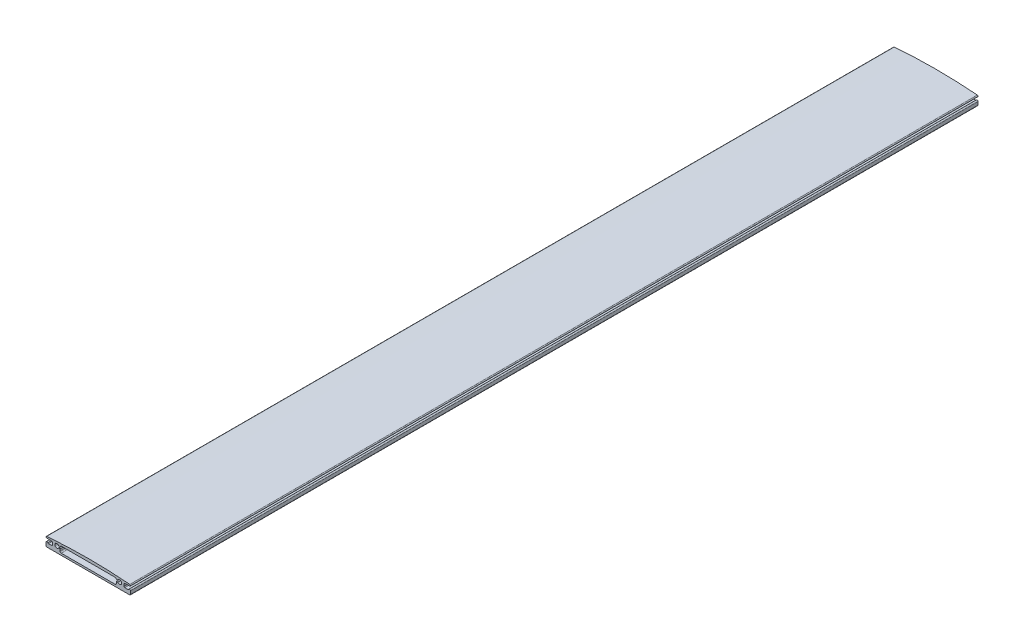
ISO-10303-21;
HEADER;
FILE_DESCRIPTION(('STEP AP214'),'2;1');
FILE_NAME('part.step','',(''),(''),'','','');
FILE_SCHEMA(('AUTOMOTIVE_DESIGN { 1 0 10303 214 1 1 1 1 }'));
ENDSEC;
DATA;
#1=APPLICATION_CONTEXT('core data for automotive mechanical design processes');
#2=APPLICATION_PROTOCOL_DEFINITION('international standard','automotive_design',2000,#1);
#3=PRODUCT_CONTEXT('',#1,'mechanical');
#4=PRODUCT('Part','Part','',(#3));
#5=PRODUCT_RELATED_PRODUCT_CATEGORY('part','',(#4));
#6=PRODUCT_DEFINITION_FORMATION('','',#4);
#7=PRODUCT_DEFINITION_CONTEXT('part definition',#1,'design');
#8=PRODUCT_DEFINITION('design','',#6,#7);
#9=PRODUCT_DEFINITION_SHAPE('','',#8);
#10=(LENGTH_UNIT() NAMED_UNIT(*) SI_UNIT(.MILLI.,.METRE.));
#11=(NAMED_UNIT(*) PLANE_ANGLE_UNIT() SI_UNIT($,.RADIAN.));
#12=(NAMED_UNIT(*) SI_UNIT($,.STERADIAN.) SOLID_ANGLE_UNIT());
#13=UNCERTAINTY_MEASURE_WITH_UNIT(LENGTH_MEASURE(1.E-05),#10,'distance_accuracy_value','');
#14=(GEOMETRIC_REPRESENTATION_CONTEXT(3) GLOBAL_UNCERTAINTY_ASSIGNED_CONTEXT((#13)) GLOBAL_UNIT_ASSIGNED_CONTEXT((#10,
#11,#12)) REPRESENTATION_CONTEXT('',''));
#15=CARTESIAN_POINT('',(0.,0.,0.));
#16=DIRECTION('',(0.,0.,1.));
#17=DIRECTION('',(1.,0.,0.));
#18=AXIS2_PLACEMENT_3D('',#15,#16,#17);
#19=CARTESIAN_POINT('',(32.4,-4.4,331.15));
#20=DIRECTION('',(0.,0.,-1.));
#21=DIRECTION('',(-1.,0.,0.));
#22=AXIS2_PLACEMENT_3D('',#19,#20,#21);
#23=PLANE('',#22);
#24=DIRECTION('',(1.,0.,0.));
#25=VECTOR('',#24,1.);
#26=CARTESIAN_POINT('',(-22.,-5.,331.15));
#27=LINE('',#26,#25);
#28=CARTESIAN_POINT('',(-32.4,-5.,331.15));
#29=VERTEX_POINT('',#28);
#30=CARTESIAN_POINT('',(32.4,-5.00000000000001,331.15));
#31=VERTEX_POINT('',#30);
#32=EDGE_CURVE('E317',#29,#31,#27,.T.);
#33=ORIENTED_EDGE('',*,*,#32,.T.);
#34=CARTESIAN_POINT('',(32.4,-4.4,331.15));
#35=DIRECTION('',(0.,0.,1.));
#36=DIRECTION('',(-1.,0.,0.));
#37=AXIS2_PLACEMENT_3D('',#34,#35,#36);
#38=CIRCLE('',#37,0.600000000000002);
#39=CARTESIAN_POINT('',(33.,-4.4,331.15));
#40=VERTEX_POINT('',#39);
#41=EDGE_CURVE('E319',#31,#40,#38,.T.);
#42=ORIENTED_EDGE('',*,*,#41,.T.);
#43=DIRECTION('',(0.,1.,0.));
#44=VECTOR('',#43,1.);
#45=CARTESIAN_POINT('',(33.,-4.4,331.15));
#46=LINE('',#45,#44);
#47=CARTESIAN_POINT('',(33.,-2.,331.15));
#48=VERTEX_POINT('',#47);
#49=EDGE_CURVE('E322',#40,#48,#46,.T.);
#50=ORIENTED_EDGE('',*,*,#49,.T.);
#51=CARTESIAN_POINT('',(32.25,-2.,331.15));
#52=DIRECTION('',(0.,0.,1.));
#53=DIRECTION('',(-1.,0.,0.));
#54=AXIS2_PLACEMENT_3D('',#51,#52,#53);
#55=CIRCLE('',#54,0.75);
#56=CARTESIAN_POINT('',(31.5626136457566,-1.7,331.15));
#57=VERTEX_POINT('',#56);
#58=EDGE_CURVE('E324',#48,#57,#55,.T.);
#59=ORIENTED_EDGE('',*,*,#58,.T.);
#60=CARTESIAN_POINT('',(31.104356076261,-1.5,331.15));
#61=DIRECTION('',(0.,0.,-1.));
#62=DIRECTION('',(-1.,0.,0.));
#63=AXIS2_PLACEMENT_3D('',#60,#61,#62);
#64=CIRCLE('',#63,0.500000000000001);
#65=CARTESIAN_POINT('',(31.104356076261,-2.,331.15));
#66=VERTEX_POINT('',#65);
#67=EDGE_CURVE('E326',#57,#66,#64,.T.);
#68=ORIENTED_EDGE('',*,*,#67,.T.);
#69=DIRECTION('',(-1.,0.,0.));
#70=VECTOR('',#69,1.);
#71=CARTESIAN_POINT('',(31.104356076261,-2.,331.15));
#72=LINE('',#71,#70);
#73=CARTESIAN_POINT('',(28.6,-2.,331.15));
#74=VERTEX_POINT('',#73);
#75=EDGE_CURVE('E328',#66,#74,#72,.T.);
#76=ORIENTED_EDGE('',*,*,#75,.T.);
#77=CARTESIAN_POINT('',(28.6,-1.4,331.15));
#78=DIRECTION('',(0.,0.,-1.));
#79=DIRECTION('',(1.,0.,0.));
#80=AXIS2_PLACEMENT_3D('',#77,#78,#79);
#81=CIRCLE('',#80,0.6);
#82=CARTESIAN_POINT('',(28.,-1.4,331.15));
#83=VERTEX_POINT('',#82);
#84=EDGE_CURVE('E330',#74,#83,#81,.T.);
#85=ORIENTED_EDGE('',*,*,#84,.T.);
#86=DIRECTION('',(0.,1.,0.));
#87=VECTOR('',#86,1.);
#88=CARTESIAN_POINT('',(28.,0.149999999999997,331.15));
#89=LINE('',#88,#87);
#90=CARTESIAN_POINT('',(28.,0.149999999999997,331.15));
#91=VERTEX_POINT('',#90);
#92=EDGE_CURVE('E332',#83,#91,#89,.T.);
#93=ORIENTED_EDGE('',*,*,#92,.T.);
#94=CARTESIAN_POINT('',(28.85,0.149999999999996,331.15));
#95=DIRECTION('',(0.,0.,-1.));
#96=DIRECTION('',(-1.,0.,0.));
#97=AXIS2_PLACEMENT_3D('',#94,#95,#96);
#98=CIRCLE('',#97,0.850000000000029);
#99=CARTESIAN_POINT('',(28.85,0.999999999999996,331.15));
#100=VERTEX_POINT('',#99);
#101=EDGE_CURVE('E334',#91,#100,#98,.T.);
#102=ORIENTED_EDGE('',*,*,#101,.T.);
#103=DIRECTION('',(1.,0.,0.));
#104=VECTOR('',#103,1.);
#105=CARTESIAN_POINT('',(32.3999999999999,0.999999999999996,331.15));
#106=LINE('',#105,#104);
#107=CARTESIAN_POINT('',(32.3999999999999,0.999999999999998,331.15));
#108=VERTEX_POINT('',#107);
#109=EDGE_CURVE('E336',#100,#108,#106,.T.);
#110=ORIENTED_EDGE('',*,*,#109,.T.);
#111=CARTESIAN_POINT('',(32.4,1.60048941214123,331.15));
#112=DIRECTION('',(0.,0.,1.));
#113=DIRECTION('',(1.,0.,0.));
#114=AXIS2_PLACEMENT_3D('',#111,#112,#113);
#115=CIRCLE('',#114,0.600489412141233);
#116=CARTESIAN_POINT('',(32.4484386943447,2.19902197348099,331.15));
#117=VERTEX_POINT('',#116);
#118=EDGE_CURVE('E338',#108,#117,#115,.T.);
#119=ORIENTED_EDGE('',*,*,#118,.T.);
#120=CARTESIAN_POINT('',(0.,-398.75,331.15));
#121=DIRECTION('',(0.,0.,1.));
#122=DIRECTION('',(-1.,0.,0.));
#123=AXIS2_PLACEMENT_3D('',#120,#121,#122);
#124=CIRCLE('',#123,402.259890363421);
#125=CARTESIAN_POINT('',(-32.4484386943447,2.19902197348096,331.15));
#126=VERTEX_POINT('',#125);
#127=EDGE_CURVE('E340',#117,#126,#124,.T.);
#128=ORIENTED_EDGE('',*,*,#127,.T.);
#129=CARTESIAN_POINT('',(-32.4,1.60048941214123,331.15));
#130=DIRECTION('',(0.,0.,1.));
#131=DIRECTION('',(-1.,0.,0.));
#132=AXIS2_PLACEMENT_3D('',#129,#130,#131);
#133=CIRCLE('',#132,0.600489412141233);
#134=CARTESIAN_POINT('',(-32.3999999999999,0.999999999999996,331.15));
#135=VERTEX_POINT('',#134);
#136=EDGE_CURVE('E342',#126,#135,#133,.T.);
#137=ORIENTED_EDGE('',*,*,#136,.T.);
#138=DIRECTION('',(1.,0.,0.));
#139=VECTOR('',#138,1.);
#140=CARTESIAN_POINT('',(-32.3999999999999,0.999999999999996,331.15));
#141=LINE('',#140,#139);
#142=CARTESIAN_POINT('',(-28.85,1.00000000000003,331.15));
#143=VERTEX_POINT('',#142);
#144=EDGE_CURVE('E344',#135,#143,#141,.T.);
#145=ORIENTED_EDGE('',*,*,#144,.T.);
#146=CARTESIAN_POINT('',(-28.85,0.149999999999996,331.15));
#147=DIRECTION('',(0.,0.,-1.));
#148=DIRECTION('',(1.,0.,0.));
#149=AXIS2_PLACEMENT_3D('',#146,#147,#148);
#150=CIRCLE('',#149,0.850000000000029);
#151=CARTESIAN_POINT('',(-28.,0.149999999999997,331.15));
#152=VERTEX_POINT('',#151);
#153=EDGE_CURVE('E346',#143,#152,#150,.T.);
#154=ORIENTED_EDGE('',*,*,#153,.T.);
#155=DIRECTION('',(0.,-1.,0.));
#156=VECTOR('',#155,1.);
#157=CARTESIAN_POINT('',(-28.,0.149999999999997,331.15));
#158=LINE('',#157,#156);
#159=CARTESIAN_POINT('',(-28.,-1.4,331.15));
#160=VERTEX_POINT('',#159);
#161=EDGE_CURVE('E348',#152,#160,#158,.T.);
#162=ORIENTED_EDGE('',*,*,#161,.T.);
#163=CARTESIAN_POINT('',(-28.6,-1.4,331.15));
#164=DIRECTION('',(0.,0.,-1.));
#165=DIRECTION('',(-1.,0.,0.));
#166=AXIS2_PLACEMENT_3D('',#163,#164,#165);
#167=CIRCLE('',#166,0.6);
#168=CARTESIAN_POINT('',(-28.6,-2.,331.15));
#169=VERTEX_POINT('',#168);
#170=EDGE_CURVE('E350',#160,#169,#167,.T.);
#171=ORIENTED_EDGE('',*,*,#170,.T.);
#172=DIRECTION('',(-1.,0.,0.));
#173=VECTOR('',#172,1.);
#174=CARTESIAN_POINT('',(-31.104356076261,-2.,331.15));
#175=LINE('',#174,#173);
#176=CARTESIAN_POINT('',(-31.104356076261,-2.,331.15));
#177=VERTEX_POINT('',#176);
#178=EDGE_CURVE('E352',#169,#177,#175,.T.);
#179=ORIENTED_EDGE('',*,*,#178,.T.);
#180=CARTESIAN_POINT('',(-31.104356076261,-1.5,331.15));
#181=DIRECTION('',(0.,0.,-1.));
#182=DIRECTION('',(1.,0.,0.));
#183=AXIS2_PLACEMENT_3D('',#180,#181,#182);
#184=CIRCLE('',#183,0.500000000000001);
#185=CARTESIAN_POINT('',(-31.5626136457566,-1.7,331.15));
#186=VERTEX_POINT('',#185);
#187=EDGE_CURVE('E354',#177,#186,#184,.T.);
#188=ORIENTED_EDGE('',*,*,#187,.T.);
#189=CARTESIAN_POINT('',(-32.25,-2.,331.15));
#190=DIRECTION('',(0.,0.,1.));
#191=DIRECTION('',(1.,0.,0.));
#192=AXIS2_PLACEMENT_3D('',#189,#190,#191);
#193=CIRCLE('',#192,0.75);
#194=CARTESIAN_POINT('',(-33.,-2.,331.15));
#195=VERTEX_POINT('',#194);
#196=EDGE_CURVE('E356',#186,#195,#193,.T.);
#197=ORIENTED_EDGE('',*,*,#196,.T.);
#198=DIRECTION('',(0.,-1.,0.));
#199=VECTOR('',#198,1.);
#200=CARTESIAN_POINT('',(-33.,-4.4,331.15));
#201=LINE('',#200,#199);
#202=CARTESIAN_POINT('',(-33.,-4.4,331.15));
#203=VERTEX_POINT('',#202);
#204=EDGE_CURVE('E358',#195,#203,#201,.T.);
#205=ORIENTED_EDGE('',*,*,#204,.T.);
#206=CARTESIAN_POINT('',(-32.4,-4.4,331.15));
#207=DIRECTION('',(0.,0.,1.));
#208=DIRECTION('',(1.,0.,0.));
#209=AXIS2_PLACEMENT_3D('',#206,#207,#208);
#210=CIRCLE('',#209,0.600000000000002);
#211=EDGE_CURVE('E360',#203,#29,#210,.T.);
#212=ORIENTED_EDGE('',*,*,#211,.T.);
#213=EDGE_LOOP('',(#33,#42,#50,#59,#68,#76,#85,#93,#102,#110,#119,#128,#137,#145,#154,#162,#171,
#179,#188,#197,#205,#212));
#214=FACE_BOUND('',#213,.T.);
#215=DIRECTION('',(0.,-1.,0.));
#216=VECTOR('',#215,1.);
#217=CARTESIAN_POINT('',(-22.,-2.50000000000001,331.15));
#218=LINE('',#217,#216);
#219=CARTESIAN_POINT('',(-22.,-1.,331.15));
#220=VERTEX_POINT('',#219);
#221=CARTESIAN_POINT('',(-22.,-2.50000000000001,331.15));
#222=VERTEX_POINT('',#221);
#223=EDGE_CURVE('E916',#220,#222,#218,.T.);
#224=ORIENTED_EDGE('',*,*,#223,.F.);
#225=DIRECTION('',(1.,0.,0.));
#226=VECTOR('',#225,1.);
#227=CARTESIAN_POINT('',(-23.0853950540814,-1.,331.15));
#228=LINE('',#227,#226);
#229=CARTESIAN_POINT('',(-23.0853950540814,-1.,331.15));
#230=VERTEX_POINT('',#229);
#231=EDGE_CURVE('E31',#230,#220,#228,.T.);
#232=ORIENTED_EDGE('',*,*,#231,.F.);
#233=CARTESIAN_POINT('',(-24.4987244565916,-0.250000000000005,331.15));
#234=DIRECTION('',(0.,0.,1.));
#235=DIRECTION('',(1.,0.,0.));
#236=AXIS2_PLACEMENT_3D('',#233,#234,#235);
#237=CIRCLE('',#236,1.6);
#238=CARTESIAN_POINT('',(-23.0853950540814,0.499999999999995,331.15));
#239=VERTEX_POINT('',#238);
#240=EDGE_CURVE('E909',#239,#230,#237,.T.);
#241=ORIENTED_EDGE('',*,*,#240,.F.);
#242=DIRECTION('',(-1.,0.,0.));
#243=VECTOR('',#242,1.);
#244=CARTESIAN_POINT('',(-23.0853950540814,0.499999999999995,331.15));
#245=LINE('',#244,#243);
#246=CARTESIAN_POINT('',(-21.9682458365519,0.499999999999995,331.15));
#247=VERTEX_POINT('',#246);
#248=EDGE_CURVE('E912',#247,#239,#245,.T.);
#249=ORIENTED_EDGE('',*,*,#248,.F.);
#250=CARTESIAN_POINT('',(-21.,0.249999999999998,331.15));
#251=DIRECTION('',(0.,0.,1.));
#252=DIRECTION('',(-1.,0.,0.));
#253=AXIS2_PLACEMENT_3D('',#250,#251,#252);
#254=CIRCLE('',#253,1.);
#255=CARTESIAN_POINT('',(-21.,1.25,331.15));
#256=VERTEX_POINT('',#255);
#257=EDGE_CURVE('E268',#256,#247,#254,.T.);
#258=ORIENTED_EDGE('',*,*,#257,.F.);
#259=DIRECTION('',(-1.,0.,0.));
#260=VECTOR('',#259,1.);
#261=CARTESIAN_POINT('',(-21.,1.25,331.15));
#262=LINE('',#261,#260);
#263=CARTESIAN_POINT('',(21.,1.25,331.15));
#264=VERTEX_POINT('',#263);
#265=EDGE_CURVE('E285',#264,#256,#262,.T.);
#266=ORIENTED_EDGE('',*,*,#265,.F.);
#267=CARTESIAN_POINT('',(21.,0.249999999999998,331.15));
#268=DIRECTION('',(0.,0.,1.));
#269=DIRECTION('',(1.,0.,0.));
#270=AXIS2_PLACEMENT_3D('',#267,#268,#269);
#271=CIRCLE('',#270,1.);
#272=CARTESIAN_POINT('',(21.9682458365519,0.499999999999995,331.15));
#273=VERTEX_POINT('',#272);
#274=EDGE_CURVE('E955',#273,#264,#271,.T.);
#275=ORIENTED_EDGE('',*,*,#274,.F.);
#276=DIRECTION('',(-1.,0.,0.));
#277=VECTOR('',#276,1.);
#278=CARTESIAN_POINT('',(23.0853950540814,0.499999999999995,331.15));
#279=LINE('',#278,#277);
#280=CARTESIAN_POINT('',(23.0853950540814,0.499999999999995,331.15));
#281=VERTEX_POINT('',#280);
#282=EDGE_CURVE('E39',#281,#273,#279,.T.);
#283=ORIENTED_EDGE('',*,*,#282,.F.);
#284=CARTESIAN_POINT('',(24.4987244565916,-0.250000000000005,331.15));
#285=DIRECTION('',(0.,0.,1.));
#286=DIRECTION('',(-1.,0.,0.));
#287=AXIS2_PLACEMENT_3D('',#284,#285,#286);
#288=CIRCLE('',#287,1.6);
#289=CARTESIAN_POINT('',(23.0853950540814,-1.00000000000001,331.15));
#290=VERTEX_POINT('',#289);
#291=EDGE_CURVE('E937',#290,#281,#288,.T.);
#292=ORIENTED_EDGE('',*,*,#291,.F.);
#293=DIRECTION('',(1.,0.,0.));
#294=VECTOR('',#293,1.);
#295=CARTESIAN_POINT('',(23.0853950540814,-1.,331.15));
#296=LINE('',#295,#294);
#297=CARTESIAN_POINT('',(22.,-1.,331.15));
#298=VERTEX_POINT('',#297);
#299=EDGE_CURVE('E922',#298,#290,#296,.T.);
#300=ORIENTED_EDGE('',*,*,#299,.F.);
#301=DIRECTION('',(0.,1.,0.));
#302=VECTOR('',#301,1.);
#303=CARTESIAN_POINT('',(22.,-2.5,331.15));
#304=LINE('',#303,#302);
#305=CARTESIAN_POINT('',(22.,-2.5,331.15));
#306=VERTEX_POINT('',#305);
#307=EDGE_CURVE('E953',#306,#298,#304,.T.);
#308=ORIENTED_EDGE('',*,*,#307,.F.);
#309=CARTESIAN_POINT('',(21.,-2.5,331.15));
#310=DIRECTION('',(0.,0.,1.));
#311=DIRECTION('',(-1.,0.,0.));
#312=AXIS2_PLACEMENT_3D('',#309,#310,#311);
#313=CIRCLE('',#312,1.);
#314=CARTESIAN_POINT('',(21.,-3.5,331.15));
#315=VERTEX_POINT('',#314);
#316=EDGE_CURVE('E951',#315,#306,#313,.T.);
#317=ORIENTED_EDGE('',*,*,#316,.F.);
#318=DIRECTION('',(1.,0.,0.));
#319=VECTOR('',#318,1.);
#320=CARTESIAN_POINT('',(21.,-3.5,331.15));
#321=LINE('',#320,#319);
#322=CARTESIAN_POINT('',(-21.,-3.50000000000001,331.15));
#323=VERTEX_POINT('',#322);
#324=EDGE_CURVE('E949',#323,#315,#321,.T.);
#325=ORIENTED_EDGE('',*,*,#324,.F.);
#326=CARTESIAN_POINT('',(-21.,-2.50000000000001,331.15));
#327=DIRECTION('',(0.,0.,1.));
#328=DIRECTION('',(-1.,0.,0.));
#329=AXIS2_PLACEMENT_3D('',#326,#327,#328);
#330=CIRCLE('',#329,1.);
#331=EDGE_CURVE('E947',#222,#323,#330,.T.);
#332=ORIENTED_EDGE('',*,*,#331,.F.);
#333=EDGE_LOOP('',(#224,#232,#241,#249,#258,#266,#275,#283,#292,#300,#308,#317,#325,#332));
#334=FACE_BOUND('',#333,.T.);
#335=ADVANCED_FACE('F16',(#214,#334),#23,.F.);
#336=CARTESIAN_POINT('',(32.4,-4.4,-331.15));
#337=DIRECTION('',(0.,0.,-1.));
#338=DIRECTION('',(-1.,0.,0.));
#339=AXIS2_PLACEMENT_3D('',#336,#337,#338);
#340=PLANE('',#339);
#341=DIRECTION('',(1.,0.,0.));
#342=VECTOR('',#341,1.);
#343=CARTESIAN_POINT('',(-23.0853950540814,-1.,-331.15));
#344=LINE('',#343,#342);
#345=CARTESIAN_POINT('',(-23.0853950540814,-1.,-331.15));
#346=VERTEX_POINT('',#345);
#347=CARTESIAN_POINT('',(-22.,-1.,-331.15));
#348=VERTEX_POINT('',#347);
#349=EDGE_CURVE('E269',#346,#348,#344,.T.);
#350=ORIENTED_EDGE('',*,*,#349,.T.);
#351=DIRECTION('',(0.,-1.,0.));
#352=VECTOR('',#351,1.);
#353=CARTESIAN_POINT('',(-22.,-2.50000000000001,-331.15));
#354=LINE('',#353,#352);
#355=CARTESIAN_POINT('',(-22.,-2.50000000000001,-331.15));
#356=VERTEX_POINT('',#355);
#357=EDGE_CURVE('E277',#348,#356,#354,.T.);
#358=ORIENTED_EDGE('',*,*,#357,.T.);
#359=CARTESIAN_POINT('',(-21.,-2.50000000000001,-331.15));
#360=DIRECTION('',(0.,0.,1.));
#361=DIRECTION('',(-1.,0.,0.));
#362=AXIS2_PLACEMENT_3D('',#359,#360,#361);
#363=CIRCLE('',#362,1.);
#364=CARTESIAN_POINT('',(-21.,-3.50000000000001,-331.15));
#365=VERTEX_POINT('',#364);
#366=EDGE_CURVE('E280',#356,#365,#363,.T.);
#367=ORIENTED_EDGE('',*,*,#366,.T.);
#368=DIRECTION('',(1.,0.,0.));
#369=VECTOR('',#368,1.);
#370=CARTESIAN_POINT('',(21.,-3.5,-331.15));
#371=LINE('',#370,#369);
#372=CARTESIAN_POINT('',(21.,-3.5,-331.15));
#373=VERTEX_POINT('',#372);
#374=EDGE_CURVE('E290',#365,#373,#371,.T.);
#375=ORIENTED_EDGE('',*,*,#374,.T.);
#376=CARTESIAN_POINT('',(21.,-2.5,-331.15));
#377=DIRECTION('',(0.,0.,1.));
#378=DIRECTION('',(-1.,0.,0.));
#379=AXIS2_PLACEMENT_3D('',#376,#377,#378);
#380=CIRCLE('',#379,1.);
#381=CARTESIAN_POINT('',(22.,-2.5,-331.15));
#382=VERTEX_POINT('',#381);
#383=EDGE_CURVE('E293',#373,#382,#380,.T.);
#384=ORIENTED_EDGE('',*,*,#383,.T.);
#385=DIRECTION('',(0.,1.,0.));
#386=VECTOR('',#385,1.);
#387=CARTESIAN_POINT('',(22.,-2.5,-331.15));
#388=LINE('',#387,#386);
#389=CARTESIAN_POINT('',(22.,-1.,-331.15));
#390=VERTEX_POINT('',#389);
#391=EDGE_CURVE('E296',#382,#390,#388,.T.);
#392=ORIENTED_EDGE('',*,*,#391,.T.);
#393=DIRECTION('',(1.,0.,0.));
#394=VECTOR('',#393,1.);
#395=CARTESIAN_POINT('',(23.0853950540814,-1.,-331.15));
#396=LINE('',#395,#394);
#397=CARTESIAN_POINT('',(23.0853950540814,-1.00000000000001,-331.15));
#398=VERTEX_POINT('',#397);
#399=EDGE_CURVE('E925',#390,#398,#396,.T.);
#400=ORIENTED_EDGE('',*,*,#399,.T.);
#401=CARTESIAN_POINT('',(24.4987244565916,-0.250000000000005,-331.15));
#402=DIRECTION('',(0.,0.,1.));
#403=DIRECTION('',(-1.,0.,0.));
#404=AXIS2_PLACEMENT_3D('',#401,#402,#403);
#405=CIRCLE('',#404,1.6);
#406=CARTESIAN_POINT('',(23.0853950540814,0.499999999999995,-331.15));
#407=VERTEX_POINT('',#406);
#408=EDGE_CURVE('E928',#398,#407,#405,.T.);
#409=ORIENTED_EDGE('',*,*,#408,.T.);
#410=DIRECTION('',(-1.,0.,0.));
#411=VECTOR('',#410,1.);
#412=CARTESIAN_POINT('',(23.0853950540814,0.499999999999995,-331.15));
#413=LINE('',#412,#411);
#414=CARTESIAN_POINT('',(21.9682458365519,0.499999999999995,-331.15));
#415=VERTEX_POINT('',#414);
#416=EDGE_CURVE('E931',#407,#415,#413,.T.);
#417=ORIENTED_EDGE('',*,*,#416,.T.);
#418=CARTESIAN_POINT('',(21.,0.249999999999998,-331.15));
#419=DIRECTION('',(0.,0.,1.));
#420=DIRECTION('',(1.,0.,0.));
#421=AXIS2_PLACEMENT_3D('',#418,#419,#420);
#422=CIRCLE('',#421,1.);
#423=CARTESIAN_POINT('',(21.,1.25,-331.15));
#424=VERTEX_POINT('',#423);
#425=EDGE_CURVE('E299',#415,#424,#422,.T.);
#426=ORIENTED_EDGE('',*,*,#425,.T.);
#427=DIRECTION('',(-1.,0.,0.));
#428=VECTOR('',#427,1.);
#429=CARTESIAN_POINT('',(-21.,1.25,-331.15));
#430=LINE('',#429,#428);
#431=CARTESIAN_POINT('',(-21.,1.25,-331.15));
#432=VERTEX_POINT('',#431);
#433=EDGE_CURVE('E276',#424,#432,#430,.T.);
#434=ORIENTED_EDGE('',*,*,#433,.T.);
#435=CARTESIAN_POINT('',(-21.,0.249999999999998,-331.15));
#436=DIRECTION('',(0.,0.,1.));
#437=DIRECTION('',(-1.,0.,0.));
#438=AXIS2_PLACEMENT_3D('',#435,#436,#437);
#439=CIRCLE('',#438,1.);
#440=CARTESIAN_POINT('',(-21.9682458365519,0.499999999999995,-331.15));
#441=VERTEX_POINT('',#440);
#442=EDGE_CURVE('E265',#432,#441,#439,.T.);
#443=ORIENTED_EDGE('',*,*,#442,.T.);
#444=DIRECTION('',(-1.,0.,0.));
#445=VECTOR('',#444,1.);
#446=CARTESIAN_POINT('',(-23.0853950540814,0.499999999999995,-331.15));
#447=LINE('',#446,#445);
#448=CARTESIAN_POINT('',(-23.0853950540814,0.499999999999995,-331.15));
#449=VERTEX_POINT('',#448);
#450=EDGE_CURVE('E248',#441,#449,#447,.T.);
#451=ORIENTED_EDGE('',*,*,#450,.T.);
#452=CARTESIAN_POINT('',(-24.4987244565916,-0.250000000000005,-331.15));
#453=DIRECTION('',(0.,0.,1.));
#454=DIRECTION('',(1.,0.,0.));
#455=AXIS2_PLACEMENT_3D('',#452,#453,#454);
#456=CIRCLE('',#455,1.6);
#457=EDGE_CURVE('E259',#449,#346,#456,.T.);
#458=ORIENTED_EDGE('',*,*,#457,.T.);
#459=EDGE_LOOP('',(#350,#358,#367,#375,#384,#392,#400,#409,#417,#426,#434,#443,#451,#458));
#460=FACE_BOUND('',#459,.T.);
#461=CARTESIAN_POINT('',(32.4,-4.4,-331.15));
#462=DIRECTION('',(0.,0.,1.));
#463=DIRECTION('',(-1.,0.,0.));
#464=AXIS2_PLACEMENT_3D('',#461,#462,#463);
#465=CIRCLE('',#464,0.600000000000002);
#466=CARTESIAN_POINT('',(32.4,-5.00000000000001,-331.15));
#467=VERTEX_POINT('',#466);
#468=CARTESIAN_POINT('',(33.,-4.4,-331.15));
#469=VERTEX_POINT('',#468);
#470=EDGE_CURVE('E316',#467,#469,#465,.T.);
#471=ORIENTED_EDGE('',*,*,#470,.F.);
#472=DIRECTION('',(1.,0.,0.));
#473=VECTOR('',#472,1.);
#474=CARTESIAN_POINT('',(-22.,-5.,-331.15));
#475=LINE('',#474,#473);
#476=CARTESIAN_POINT('',(-32.4,-5.,-331.15));
#477=VERTEX_POINT('',#476);
#478=EDGE_CURVE('E320',#477,#467,#475,.T.);
#479=ORIENTED_EDGE('',*,*,#478,.F.);
#480=CARTESIAN_POINT('',(-32.4,-4.4,-331.15));
#481=DIRECTION('',(0.,0.,1.));
#482=DIRECTION('',(1.,0.,0.));
#483=AXIS2_PLACEMENT_3D('',#480,#481,#482);
#484=CIRCLE('',#483,0.600000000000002);
#485=CARTESIAN_POINT('',(-33.,-4.4,-331.15));
#486=VERTEX_POINT('',#485);
#487=EDGE_CURVE('E403',#486,#477,#484,.T.);
#488=ORIENTED_EDGE('',*,*,#487,.F.);
#489=DIRECTION('',(0.,-1.,0.));
#490=VECTOR('',#489,1.);
#491=CARTESIAN_POINT('',(-33.,-4.4,-331.15));
#492=LINE('',#491,#490);
#493=CARTESIAN_POINT('',(-33.,-2.,-331.15));
#494=VERTEX_POINT('',#493);
#495=EDGE_CURVE('E401',#494,#486,#492,.T.);
#496=ORIENTED_EDGE('',*,*,#495,.F.);
#497=CARTESIAN_POINT('',(-32.25,-2.,-331.15));
#498=DIRECTION('',(0.,0.,1.));
#499=DIRECTION('',(1.,0.,0.));
#500=AXIS2_PLACEMENT_3D('',#497,#498,#499);
#501=CIRCLE('',#500,0.75);
#502=CARTESIAN_POINT('',(-31.5626136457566,-1.7,-331.15));
#503=VERTEX_POINT('',#502);
#504=EDGE_CURVE('E399',#503,#494,#501,.T.);
#505=ORIENTED_EDGE('',*,*,#504,.F.);
#506=CARTESIAN_POINT('',(-31.104356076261,-1.5,-331.15));
#507=DIRECTION('',(0.,0.,-1.));
#508=DIRECTION('',(1.,0.,0.));
#509=AXIS2_PLACEMENT_3D('',#506,#507,#508);
#510=CIRCLE('',#509,0.500000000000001);
#511=CARTESIAN_POINT('',(-31.104356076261,-2.,-331.15));
#512=VERTEX_POINT('',#511);
#513=EDGE_CURVE('E397',#512,#503,#510,.T.);
#514=ORIENTED_EDGE('',*,*,#513,.F.);
#515=DIRECTION('',(-1.,0.,0.));
#516=VECTOR('',#515,1.);
#517=CARTESIAN_POINT('',(-31.104356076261,-2.,-331.15));
#518=LINE('',#517,#516);
#519=CARTESIAN_POINT('',(-28.6,-2.,-331.15));
#520=VERTEX_POINT('',#519);
#521=EDGE_CURVE('E395',#520,#512,#518,.T.);
#522=ORIENTED_EDGE('',*,*,#521,.F.);
#523=CARTESIAN_POINT('',(-28.6,-1.4,-331.15));
#524=DIRECTION('',(0.,0.,-1.));
#525=DIRECTION('',(-1.,0.,0.));
#526=AXIS2_PLACEMENT_3D('',#523,#524,#525);
#527=CIRCLE('',#526,0.6);
#528=CARTESIAN_POINT('',(-28.,-1.4,-331.15));
#529=VERTEX_POINT('',#528);
#530=EDGE_CURVE('E393',#529,#520,#527,.T.);
#531=ORIENTED_EDGE('',*,*,#530,.F.);
#532=DIRECTION('',(0.,-1.,0.));
#533=VECTOR('',#532,1.);
#534=CARTESIAN_POINT('',(-28.,0.149999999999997,-331.15));
#535=LINE('',#534,#533);
#536=CARTESIAN_POINT('',(-28.,0.149999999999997,-331.15));
#537=VERTEX_POINT('',#536);
#538=EDGE_CURVE('E391',#537,#529,#535,.T.);
#539=ORIENTED_EDGE('',*,*,#538,.F.);
#540=CARTESIAN_POINT('',(-28.85,0.149999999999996,-331.15));
#541=DIRECTION('',(0.,0.,-1.));
#542=DIRECTION('',(1.,0.,0.));
#543=AXIS2_PLACEMENT_3D('',#540,#541,#542);
#544=CIRCLE('',#543,0.850000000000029);
#545=CARTESIAN_POINT('',(-28.85,1.00000000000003,-331.15));
#546=VERTEX_POINT('',#545);
#547=EDGE_CURVE('E389',#546,#537,#544,.T.);
#548=ORIENTED_EDGE('',*,*,#547,.F.);
#549=DIRECTION('',(1.,0.,0.));
#550=VECTOR('',#549,1.);
#551=CARTESIAN_POINT('',(-32.3999999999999,0.999999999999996,-331.15));
#552=LINE('',#551,#550);
#553=CARTESIAN_POINT('',(-32.3999999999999,0.999999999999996,-331.15));
#554=VERTEX_POINT('',#553);
#555=EDGE_CURVE('E387',#554,#546,#552,.T.);
#556=ORIENTED_EDGE('',*,*,#555,.F.);
#557=CARTESIAN_POINT('',(-32.4,1.60048941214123,-331.15));
#558=DIRECTION('',(0.,0.,1.));
#559=DIRECTION('',(-1.,0.,0.));
#560=AXIS2_PLACEMENT_3D('',#557,#558,#559);
#561=CIRCLE('',#560,0.600489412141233);
#562=CARTESIAN_POINT('',(-32.4484386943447,2.19902197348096,-331.15));
#563=VERTEX_POINT('',#562);
#564=EDGE_CURVE('E385',#563,#554,#561,.T.);
#565=ORIENTED_EDGE('',*,*,#564,.F.);
#566=CARTESIAN_POINT('',(0.,-398.75,-331.15));
#567=DIRECTION('',(0.,0.,1.));
#568=DIRECTION('',(-1.,0.,0.));
#569=AXIS2_PLACEMENT_3D('',#566,#567,#568);
#570=CIRCLE('',#569,402.259890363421);
#571=CARTESIAN_POINT('',(32.4484386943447,2.19902197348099,-331.15));
#572=VERTEX_POINT('',#571);
#573=EDGE_CURVE('E383',#572,#563,#570,.T.);
#574=ORIENTED_EDGE('',*,*,#573,.F.);
#575=CARTESIAN_POINT('',(32.4,1.60048941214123,-331.15));
#576=DIRECTION('',(0.,0.,1.));
#577=DIRECTION('',(1.,0.,0.));
#578=AXIS2_PLACEMENT_3D('',#575,#576,#577);
#579=CIRCLE('',#578,0.600489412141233);
#580=CARTESIAN_POINT('',(32.3999999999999,0.999999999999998,-331.15));
#581=VERTEX_POINT('',#580);
#582=EDGE_CURVE('E381',#581,#572,#579,.T.);
#583=ORIENTED_EDGE('',*,*,#582,.F.);
#584=DIRECTION('',(1.,0.,0.));
#585=VECTOR('',#584,1.);
#586=CARTESIAN_POINT('',(32.3999999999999,0.999999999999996,-331.15));
#587=LINE('',#586,#585);
#588=CARTESIAN_POINT('',(28.85,0.999999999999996,-331.15));
#589=VERTEX_POINT('',#588);
#590=EDGE_CURVE('E379',#589,#581,#587,.T.);
#591=ORIENTED_EDGE('',*,*,#590,.F.);
#592=CARTESIAN_POINT('',(28.85,0.149999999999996,-331.15));
#593=DIRECTION('',(0.,0.,-1.));
#594=DIRECTION('',(-1.,0.,0.));
#595=AXIS2_PLACEMENT_3D('',#592,#593,#594);
#596=CIRCLE('',#595,0.850000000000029);
#597=CARTESIAN_POINT('',(28.,0.149999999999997,-331.15));
#598=VERTEX_POINT('',#597);
#599=EDGE_CURVE('E377',#598,#589,#596,.T.);
#600=ORIENTED_EDGE('',*,*,#599,.F.);
#601=DIRECTION('',(0.,1.,0.));
#602=VECTOR('',#601,1.);
#603=CARTESIAN_POINT('',(28.,0.149999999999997,-331.15));
#604=LINE('',#603,#602);
#605=CARTESIAN_POINT('',(28.,-1.4,-331.15));
#606=VERTEX_POINT('',#605);
#607=EDGE_CURVE('E375',#606,#598,#604,.T.);
#608=ORIENTED_EDGE('',*,*,#607,.F.);
#609=CARTESIAN_POINT('',(28.6,-1.4,-331.15));
#610=DIRECTION('',(0.,0.,-1.));
#611=DIRECTION('',(1.,0.,0.));
#612=AXIS2_PLACEMENT_3D('',#609,#610,#611);
#613=CIRCLE('',#612,0.6);
#614=CARTESIAN_POINT('',(28.6,-2.,-331.15));
#615=VERTEX_POINT('',#614);
#616=EDGE_CURVE('E373',#615,#606,#613,.T.);
#617=ORIENTED_EDGE('',*,*,#616,.F.);
#618=DIRECTION('',(-1.,0.,0.));
#619=VECTOR('',#618,1.);
#620=CARTESIAN_POINT('',(31.104356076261,-2.,-331.15));
#621=LINE('',#620,#619);
#622=CARTESIAN_POINT('',(31.104356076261,-2.,-331.15));
#623=VERTEX_POINT('',#622);
#624=EDGE_CURVE('E371',#623,#615,#621,.T.);
#625=ORIENTED_EDGE('',*,*,#624,.F.);
#626=CARTESIAN_POINT('',(31.104356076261,-1.5,-331.15));
#627=DIRECTION('',(0.,0.,-1.));
#628=DIRECTION('',(-1.,0.,0.));
#629=AXIS2_PLACEMENT_3D('',#626,#627,#628);
#630=CIRCLE('',#629,0.500000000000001);
#631=CARTESIAN_POINT('',(31.5626136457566,-1.7,-331.15));
#632=VERTEX_POINT('',#631);
#633=EDGE_CURVE('E369',#632,#623,#630,.T.);
#634=ORIENTED_EDGE('',*,*,#633,.F.);
#635=CARTESIAN_POINT('',(32.25,-2.,-331.15));
#636=DIRECTION('',(0.,0.,1.));
#637=DIRECTION('',(-1.,0.,0.));
#638=AXIS2_PLACEMENT_3D('',#635,#636,#637);
#639=CIRCLE('',#638,0.75);
#640=CARTESIAN_POINT('',(33.,-2.,-331.15));
#641=VERTEX_POINT('',#640);
#642=EDGE_CURVE('E367',#641,#632,#639,.T.);
#643=ORIENTED_EDGE('',*,*,#642,.F.);
#644=DIRECTION('',(0.,1.,0.));
#645=VECTOR('',#644,1.);
#646=CARTESIAN_POINT('',(33.,-4.4,-331.15));
#647=LINE('',#646,#645);
#648=EDGE_CURVE('E365',#469,#641,#647,.T.);
#649=ORIENTED_EDGE('',*,*,#648,.F.);
#650=EDGE_LOOP('',(#471,#479,#488,#496,#505,#514,#522,#531,#539,#548,#556,#565,#574,#583,#591,
#600,#608,#617,#625,#634,#643,#649));
#651=FACE_BOUND('',#650,.T.);
#652=ADVANCED_FACE('F273',(#460,#651),#340,.T.);
#653=CARTESIAN_POINT('',(32.4,-4.4,331.15));
#654=DIRECTION('',(0.,0.,-1.));
#655=DIRECTION('',(-1.,0.,0.));
#656=AXIS2_PLACEMENT_3D('',#653,#654,#655);
#657=CYLINDRICAL_SURFACE('',#656,0.600000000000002);
#658=ORIENTED_EDGE('',*,*,#470,.T.);
#659=DIRECTION('',(0.,0.,-1.));
#660=VECTOR('',#659,1.);
#661=CARTESIAN_POINT('',(33.,-4.4,331.15));
#662=LINE('',#661,#660);
#663=EDGE_CURVE('E24',#40,#469,#662,.T.);
#664=ORIENTED_EDGE('',*,*,#663,.F.);
#665=ORIENTED_EDGE('',*,*,#41,.F.);
#666=DIRECTION('',(0.,0.,-1.));
#667=VECTOR('',#666,1.);
#668=CARTESIAN_POINT('',(32.4,-5.00000000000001,331.15));
#669=LINE('',#668,#667);
#670=EDGE_CURVE('E10',#31,#467,#669,.T.);
#671=ORIENTED_EDGE('',*,*,#670,.T.);
#672=EDGE_LOOP('',(#658,#664,#665,#671));
#673=FACE_BOUND('',#672,.T.);
#674=ADVANCED_FACE('F18',(#673),#657,.T.);
#675=CARTESIAN_POINT('',(33.,-4.4,331.15));
#676=DIRECTION('',(-1.,0.,0.));
#677=DIRECTION('',(0.,-1.,0.));
#678=AXIS2_PLACEMENT_3D('',#675,#676,#677);
#679=PLANE('',#678);
#680=ORIENTED_EDGE('',*,*,#648,.T.);
#681=DIRECTION('',(0.,0.,-1.));
#682=VECTOR('',#681,1.);
#683=CARTESIAN_POINT('',(33.,-2.,331.15));
#684=LINE('',#683,#682);
#685=EDGE_CURVE('E462',#48,#641,#684,.T.);
#686=ORIENTED_EDGE('',*,*,#685,.F.);
#687=ORIENTED_EDGE('',*,*,#49,.F.);
#688=ORIENTED_EDGE('',*,*,#663,.T.);
#689=EDGE_LOOP('',(#680,#686,#687,#688));
#690=FACE_BOUND('',#689,.T.);
#691=ADVANCED_FACE('F469',(#690),#679,.F.);
#692=CARTESIAN_POINT('',(32.25,-2.,331.15));
#693=DIRECTION('',(0.,0.,-1.));
#694=DIRECTION('',(-1.,0.,0.));
#695=AXIS2_PLACEMENT_3D('',#692,#693,#694);
#696=CYLINDRICAL_SURFACE('',#695,0.75);
#697=ORIENTED_EDGE('',*,*,#642,.T.);
#698=DIRECTION('',(0.,0.,-1.));
#699=VECTOR('',#698,1.);
#700=CARTESIAN_POINT('',(31.5626136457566,-1.7,331.15));
#701=LINE('',#700,#699);
#702=EDGE_CURVE('E459',#57,#632,#701,.T.);
#703=ORIENTED_EDGE('',*,*,#702,.F.);
#704=ORIENTED_EDGE('',*,*,#58,.F.);
#705=ORIENTED_EDGE('',*,*,#685,.T.);
#706=EDGE_LOOP('',(#697,#703,#704,#705));
#707=FACE_BOUND('',#706,.T.);
#708=ADVANCED_FACE('F480',(#707),#696,.T.);
#709=CARTESIAN_POINT('',(31.104356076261,-1.5,331.15));
#710=DIRECTION('',(0.,0.,-1.));
#711=DIRECTION('',(-1.,0.,0.));
#712=AXIS2_PLACEMENT_3D('',#709,#710,#711);
#713=CYLINDRICAL_SURFACE('',#712,0.500000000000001);
#714=ORIENTED_EDGE('',*,*,#633,.T.);
#715=DIRECTION('',(0.,0.,-1.));
#716=VECTOR('',#715,1.);
#717=CARTESIAN_POINT('',(31.104356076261,-2.,331.15));
#718=LINE('',#717,#716);
#719=EDGE_CURVE('E456',#66,#623,#718,.T.);
#720=ORIENTED_EDGE('',*,*,#719,.F.);
#721=ORIENTED_EDGE('',*,*,#67,.F.);
#722=ORIENTED_EDGE('',*,*,#702,.T.);
#723=EDGE_LOOP('',(#714,#720,#721,#722));
#724=FACE_BOUND('',#723,.T.);
#725=ADVANCED_FACE('F484',(#724),#713,.F.);
#726=CARTESIAN_POINT('',(31.104356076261,-2.,331.15));
#727=DIRECTION('',(0.,-1.,0.));
#728=DIRECTION('',(1.,0.,0.));
#729=AXIS2_PLACEMENT_3D('',#726,#727,#728);
#730=PLANE('',#729);
#731=ORIENTED_EDGE('',*,*,#624,.T.);
#732=DIRECTION('',(0.,0.,-1.));
#733=VECTOR('',#732,1.);
#734=CARTESIAN_POINT('',(28.6,-2.,331.15));
#735=LINE('',#734,#733);
#736=EDGE_CURVE('E453',#74,#615,#735,.T.);
#737=ORIENTED_EDGE('',*,*,#736,.F.);
#738=ORIENTED_EDGE('',*,*,#75,.F.);
#739=ORIENTED_EDGE('',*,*,#719,.T.);
#740=EDGE_LOOP('',(#731,#737,#738,#739));
#741=FACE_BOUND('',#740,.T.);
#742=ADVANCED_FACE('F574',(#741),#730,.F.);
#743=CARTESIAN_POINT('',(28.6,-1.4,331.15));
#744=DIRECTION('',(0.,0.,-1.));
#745=DIRECTION('',(-1.,0.,0.));
#746=AXIS2_PLACEMENT_3D('',#743,#744,#745);
#747=CYLINDRICAL_SURFACE('',#746,0.6);
#748=ORIENTED_EDGE('',*,*,#616,.T.);
#749=DIRECTION('',(0.,0.,-1.));
#750=VECTOR('',#749,1.);
#751=CARTESIAN_POINT('',(28.,-1.4,331.15));
#752=LINE('',#751,#750);
#753=EDGE_CURVE('E450',#83,#606,#752,.T.);
#754=ORIENTED_EDGE('',*,*,#753,.F.);
#755=ORIENTED_EDGE('',*,*,#84,.F.);
#756=ORIENTED_EDGE('',*,*,#736,.T.);
#757=EDGE_LOOP('',(#748,#754,#755,#756));
#758=FACE_BOUND('',#757,.T.);
#759=ADVANCED_FACE('F571',(#758),#747,.F.);
#760=CARTESIAN_POINT('',(28.,0.149999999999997,331.15));
#761=DIRECTION('',(-1.,0.,0.));
#762=DIRECTION('',(0.,-1.,0.));
#763=AXIS2_PLACEMENT_3D('',#760,#761,#762);
#764=PLANE('',#763);
#765=ORIENTED_EDGE('',*,*,#607,.T.);
#766=DIRECTION('',(0.,0.,-1.));
#767=VECTOR('',#766,1.);
#768=CARTESIAN_POINT('',(28.,0.149999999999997,331.15));
#769=LINE('',#768,#767);
#770=EDGE_CURVE('E447',#91,#598,#769,.T.);
#771=ORIENTED_EDGE('',*,*,#770,.F.);
#772=ORIENTED_EDGE('',*,*,#92,.F.);
#773=ORIENTED_EDGE('',*,*,#753,.T.);
#774=EDGE_LOOP('',(#765,#771,#772,#773));
#775=FACE_BOUND('',#774,.T.);
#776=ADVANCED_FACE('F567',(#775),#764,.F.);
#777=CARTESIAN_POINT('',(28.85,0.149999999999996,331.15));
#778=DIRECTION('',(0.,0.,-1.));
#779=DIRECTION('',(-1.,0.,0.));
#780=AXIS2_PLACEMENT_3D('',#777,#778,#779);
#781=CYLINDRICAL_SURFACE('',#780,0.850000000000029);
#782=ORIENTED_EDGE('',*,*,#599,.T.);
#783=DIRECTION('',(0.,0.,-1.));
#784=VECTOR('',#783,1.);
#785=CARTESIAN_POINT('',(28.85,0.999999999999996,331.15));
#786=LINE('',#785,#784);
#787=EDGE_CURVE('E444',#100,#589,#786,.T.);
#788=ORIENTED_EDGE('',*,*,#787,.F.);
#789=ORIENTED_EDGE('',*,*,#101,.F.);
#790=ORIENTED_EDGE('',*,*,#770,.T.);
#791=EDGE_LOOP('',(#782,#788,#789,#790));
#792=FACE_BOUND('',#791,.T.);
#793=ADVANCED_FACE('F563',(#792),#781,.F.);
#794=CARTESIAN_POINT('',(32.3999999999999,0.999999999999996,331.15));
#795=DIRECTION('',(0.,1.,0.));
#796=DIRECTION('',(0.,0.,1.));
#797=AXIS2_PLACEMENT_3D('',#794,#795,#796);
#798=PLANE('',#797);
#799=ORIENTED_EDGE('',*,*,#590,.T.);
#800=DIRECTION('',(0.,0.,-1.));
#801=VECTOR('',#800,1.);
#802=CARTESIAN_POINT('',(32.3999999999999,0.999999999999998,331.15));
#803=LINE('',#802,#801);
#804=EDGE_CURVE('E441',#108,#581,#803,.T.);
#805=ORIENTED_EDGE('',*,*,#804,.F.);
#806=ORIENTED_EDGE('',*,*,#109,.F.);
#807=ORIENTED_EDGE('',*,*,#787,.T.);
#808=EDGE_LOOP('',(#799,#805,#806,#807));
#809=FACE_BOUND('',#808,.T.);
#810=ADVANCED_FACE('F558',(#809),#798,.F.);
#811=CARTESIAN_POINT('',(32.4,1.60048941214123,331.15));
#812=DIRECTION('',(0.,0.,-1.));
#813=DIRECTION('',(-1.,0.,0.));
#814=AXIS2_PLACEMENT_3D('',#811,#812,#813);
#815=CYLINDRICAL_SURFACE('',#814,0.600489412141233);
#816=ORIENTED_EDGE('',*,*,#582,.T.);
#817=DIRECTION('',(0.,0.,-1.));
#818=VECTOR('',#817,1.);
#819=CARTESIAN_POINT('',(32.4484386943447,2.19902197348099,331.15));
#820=LINE('',#819,#818);
#821=EDGE_CURVE('E438',#117,#572,#820,.T.);
#822=ORIENTED_EDGE('',*,*,#821,.F.);
#823=ORIENTED_EDGE('',*,*,#118,.F.);
#824=ORIENTED_EDGE('',*,*,#804,.T.);
#825=EDGE_LOOP('',(#816,#822,#823,#824));
#826=FACE_BOUND('',#825,.T.);
#827=ADVANCED_FACE('F552',(#826),#815,.T.);
#828=CARTESIAN_POINT('',(0.,-398.75,331.15));
#829=DIRECTION('',(0.,0.,-1.));
#830=DIRECTION('',(-1.,0.,0.));
#831=AXIS2_PLACEMENT_3D('',#828,#829,#830);
#832=CYLINDRICAL_SURFACE('',#831,402.259890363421);
#833=ORIENTED_EDGE('',*,*,#573,.T.);
#834=DIRECTION('',(0.,0.,-1.));
#835=VECTOR('',#834,1.);
#836=CARTESIAN_POINT('',(-32.4484386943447,2.19902197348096,331.15));
#837=LINE('',#836,#835);
#838=EDGE_CURVE('E435',#126,#563,#837,.T.);
#839=ORIENTED_EDGE('',*,*,#838,.F.);
#840=ORIENTED_EDGE('',*,*,#127,.F.);
#841=ORIENTED_EDGE('',*,*,#821,.T.);
#842=EDGE_LOOP('',(#833,#839,#840,#841));
#843=FACE_BOUND('',#842,.T.);
#844=ADVANCED_FACE('F548',(#843),#832,.T.);
#845=CARTESIAN_POINT('',(-32.4,1.60048941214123,331.15));
#846=DIRECTION('',(0.,0.,-1.));
#847=DIRECTION('',(-1.,0.,0.));
#848=AXIS2_PLACEMENT_3D('',#845,#846,#847);
#849=CYLINDRICAL_SURFACE('',#848,0.600489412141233);
#850=ORIENTED_EDGE('',*,*,#564,.T.);
#851=DIRECTION('',(0.,0.,-1.));
#852=VECTOR('',#851,1.);
#853=CARTESIAN_POINT('',(-32.3999999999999,0.999999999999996,331.15));
#854=LINE('',#853,#852);
#855=EDGE_CURVE('E432',#135,#554,#854,.T.);
#856=ORIENTED_EDGE('',*,*,#855,.F.);
#857=ORIENTED_EDGE('',*,*,#136,.F.);
#858=ORIENTED_EDGE('',*,*,#838,.T.);
#859=EDGE_LOOP('',(#850,#856,#857,#858));
#860=FACE_BOUND('',#859,.T.);
#861=ADVANCED_FACE('F543',(#860),#849,.T.);
#862=CARTESIAN_POINT('',(-32.3999999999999,0.999999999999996,331.15));
#863=DIRECTION('',(0.,1.,0.));
#864=DIRECTION('',(0.,0.,1.));
#865=AXIS2_PLACEMENT_3D('',#862,#863,#864);
#866=PLANE('',#865);
#867=ORIENTED_EDGE('',*,*,#555,.T.);
#868=DIRECTION('',(0.,0.,-1.));
#869=VECTOR('',#868,1.);
#870=CARTESIAN_POINT('',(-28.85,1.00000000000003,331.15));
#871=LINE('',#870,#869);
#872=EDGE_CURVE('E429',#143,#546,#871,.T.);
#873=ORIENTED_EDGE('',*,*,#872,.F.);
#874=ORIENTED_EDGE('',*,*,#144,.F.);
#875=ORIENTED_EDGE('',*,*,#855,.T.);
#876=EDGE_LOOP('',(#867,#873,#874,#875));
#877=FACE_BOUND('',#876,.T.);
#878=ADVANCED_FACE('F537',(#877),#866,.F.);
#879=CARTESIAN_POINT('',(-28.85,0.149999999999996,331.15));
#880=DIRECTION('',(0.,0.,-1.));
#881=DIRECTION('',(-1.,0.,0.));
#882=AXIS2_PLACEMENT_3D('',#879,#880,#881);
#883=CYLINDRICAL_SURFACE('',#882,0.850000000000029);
#884=ORIENTED_EDGE('',*,*,#547,.T.);
#885=DIRECTION('',(0.,0.,-1.));
#886=VECTOR('',#885,1.);
#887=CARTESIAN_POINT('',(-28.,0.149999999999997,331.15));
#888=LINE('',#887,#886);
#889=EDGE_CURVE('E426',#152,#537,#888,.T.);
#890=ORIENTED_EDGE('',*,*,#889,.F.);
#891=ORIENTED_EDGE('',*,*,#153,.F.);
#892=ORIENTED_EDGE('',*,*,#872,.T.);
#893=EDGE_LOOP('',(#884,#890,#891,#892));
#894=FACE_BOUND('',#893,.T.);
#895=ADVANCED_FACE('F533',(#894),#883,.F.);
#896=CARTESIAN_POINT('',(-28.,0.149999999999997,331.15));
#897=DIRECTION('',(1.,0.,0.));
#898=DIRECTION('',(0.,1.,0.));
#899=AXIS2_PLACEMENT_3D('',#896,#897,#898);
#900=PLANE('',#899);
#901=ORIENTED_EDGE('',*,*,#538,.T.);
#902=DIRECTION('',(0.,0.,-1.));
#903=VECTOR('',#902,1.);
#904=CARTESIAN_POINT('',(-28.,-1.4,331.15));
#905=LINE('',#904,#903);
#906=EDGE_CURVE('E423',#160,#529,#905,.T.);
#907=ORIENTED_EDGE('',*,*,#906,.F.);
#908=ORIENTED_EDGE('',*,*,#161,.F.);
#909=ORIENTED_EDGE('',*,*,#889,.T.);
#910=EDGE_LOOP('',(#901,#907,#908,#909));
#911=FACE_BOUND('',#910,.T.);
#912=ADVANCED_FACE('F528',(#911),#900,.F.);
#913=CARTESIAN_POINT('',(-28.6,-1.4,331.15));
#914=DIRECTION('',(0.,0.,-1.));
#915=DIRECTION('',(-1.,0.,0.));
#916=AXIS2_PLACEMENT_3D('',#913,#914,#915);
#917=CYLINDRICAL_SURFACE('',#916,0.6);
#918=ORIENTED_EDGE('',*,*,#530,.T.);
#919=DIRECTION('',(0.,0.,-1.));
#920=VECTOR('',#919,1.);
#921=CARTESIAN_POINT('',(-28.6,-2.,331.15));
#922=LINE('',#921,#920);
#923=EDGE_CURVE('E420',#169,#520,#922,.T.);
#924=ORIENTED_EDGE('',*,*,#923,.F.);
#925=ORIENTED_EDGE('',*,*,#170,.F.);
#926=ORIENTED_EDGE('',*,*,#906,.T.);
#927=EDGE_LOOP('',(#918,#924,#925,#926));
#928=FACE_BOUND('',#927,.T.);
#929=ADVANCED_FACE('F522',(#928),#917,.F.);
#930=CARTESIAN_POINT('',(-31.104356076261,-2.,331.15));
#931=DIRECTION('',(0.,-1.,0.));
#932=DIRECTION('',(1.,0.,0.));
#933=AXIS2_PLACEMENT_3D('',#930,#931,#932);
#934=PLANE('',#933);
#935=ORIENTED_EDGE('',*,*,#521,.T.);
#936=DIRECTION('',(0.,0.,-1.));
#937=VECTOR('',#936,1.);
#938=CARTESIAN_POINT('',(-31.104356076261,-2.,331.15));
#939=LINE('',#938,#937);
#940=EDGE_CURVE('E417',#177,#512,#939,.T.);
#941=ORIENTED_EDGE('',*,*,#940,.F.);
#942=ORIENTED_EDGE('',*,*,#178,.F.);
#943=ORIENTED_EDGE('',*,*,#923,.T.);
#944=EDGE_LOOP('',(#935,#941,#942,#943));
#945=FACE_BOUND('',#944,.T.);
#946=ADVANCED_FACE('F518',(#945),#934,.F.);
#947=CARTESIAN_POINT('',(-31.104356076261,-1.5,331.15));
#948=DIRECTION('',(0.,0.,-1.));
#949=DIRECTION('',(-1.,0.,0.));
#950=AXIS2_PLACEMENT_3D('',#947,#948,#949);
#951=CYLINDRICAL_SURFACE('',#950,0.500000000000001);
#952=ORIENTED_EDGE('',*,*,#513,.T.);
#953=DIRECTION('',(0.,0.,-1.));
#954=VECTOR('',#953,1.);
#955=CARTESIAN_POINT('',(-31.5626136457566,-1.7,331.15));
#956=LINE('',#955,#954);
#957=EDGE_CURVE('E414',#186,#503,#956,.T.);
#958=ORIENTED_EDGE('',*,*,#957,.F.);
#959=ORIENTED_EDGE('',*,*,#187,.F.);
#960=ORIENTED_EDGE('',*,*,#940,.T.);
#961=EDGE_LOOP('',(#952,#958,#959,#960));
#962=FACE_BOUND('',#961,.T.);
#963=ADVANCED_FACE('F513',(#962),#951,.F.);
#964=CARTESIAN_POINT('',(-32.25,-2.,331.15));
#965=DIRECTION('',(0.,0.,-1.));
#966=DIRECTION('',(-1.,0.,0.));
#967=AXIS2_PLACEMENT_3D('',#964,#965,#966);
#968=CYLINDRICAL_SURFACE('',#967,0.75);
#969=ORIENTED_EDGE('',*,*,#504,.T.);
#970=DIRECTION('',(0.,0.,-1.));
#971=VECTOR('',#970,1.);
#972=CARTESIAN_POINT('',(-33.,-2.,331.15));
#973=LINE('',#972,#971);
#974=EDGE_CURVE('E411',#195,#494,#973,.T.);
#975=ORIENTED_EDGE('',*,*,#974,.F.);
#976=ORIENTED_EDGE('',*,*,#196,.F.);
#977=ORIENTED_EDGE('',*,*,#957,.T.);
#978=EDGE_LOOP('',(#969,#975,#976,#977));
#979=FACE_BOUND('',#978,.T.);
#980=ADVANCED_FACE('F507',(#979),#968,.T.);
#981=CARTESIAN_POINT('',(-33.,-4.4,331.15));
#982=DIRECTION('',(1.,0.,0.));
#983=DIRECTION('',(0.,1.,0.));
#984=AXIS2_PLACEMENT_3D('',#981,#982,#983);
#985=PLANE('',#984);
#986=ORIENTED_EDGE('',*,*,#495,.T.);
#987=DIRECTION('',(0.,0.,-1.));
#988=VECTOR('',#987,1.);
#989=CARTESIAN_POINT('',(-33.,-4.4,331.15));
#990=LINE('',#989,#988);
#991=EDGE_CURVE('E408',#203,#486,#990,.T.);
#992=ORIENTED_EDGE('',*,*,#991,.F.);
#993=ORIENTED_EDGE('',*,*,#204,.F.);
#994=ORIENTED_EDGE('',*,*,#974,.T.);
#995=EDGE_LOOP('',(#986,#992,#993,#994));
#996=FACE_BOUND('',#995,.T.);
#997=ADVANCED_FACE('F503',(#996),#985,.F.);
#998=CARTESIAN_POINT('',(-32.4,-4.4,331.15));
#999=DIRECTION('',(0.,0.,-1.));
#1000=DIRECTION('',(-1.,0.,0.));
#1001=AXIS2_PLACEMENT_3D('',#998,#999,#1000);
#1002=CYLINDRICAL_SURFACE('',#1001,0.600000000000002);
#1003=ORIENTED_EDGE('',*,*,#487,.T.);
#1004=DIRECTION('',(0.,0.,-1.));
#1005=VECTOR('',#1004,1.);
#1006=CARTESIAN_POINT('',(-32.4,-5.,331.15));
#1007=LINE('',#1006,#1005);
#1008=EDGE_CURVE('E363',#29,#477,#1007,.T.);
#1009=ORIENTED_EDGE('',*,*,#1008,.F.);
#1010=ORIENTED_EDGE('',*,*,#211,.F.);
#1011=ORIENTED_EDGE('',*,*,#991,.T.);
#1012=EDGE_LOOP('',(#1003,#1009,#1010,#1011));
#1013=FACE_BOUND('',#1012,.T.);
#1014=ADVANCED_FACE('F498',(#1013),#1002,.T.);
#1015=CARTESIAN_POINT('',(-22.,-5.,331.15));
#1016=DIRECTION('',(0.,1.,0.));
#1017=DIRECTION('',(-1.,0.,0.));
#1018=AXIS2_PLACEMENT_3D('',#1015,#1016,#1017);
#1019=PLANE('',#1018);
#1020=ORIENTED_EDGE('',*,*,#478,.T.);
#1021=ORIENTED_EDGE('',*,*,#670,.F.);
#1022=ORIENTED_EDGE('',*,*,#32,.F.);
#1023=ORIENTED_EDGE('',*,*,#1008,.T.);
#1024=EDGE_LOOP('',(#1020,#1021,#1022,#1023));
#1025=FACE_BOUND('',#1024,.T.);
#1026=ADVANCED_FACE('F492',(#1025),#1019,.F.);
#1027=CARTESIAN_POINT('',(-21.,0.249999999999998,331.15));
#1028=DIRECTION('',(0.,0.,-1.));
#1029=DIRECTION('',(-1.,0.,0.));
#1030=AXIS2_PLACEMENT_3D('',#1027,#1028,#1029);
#1031=CYLINDRICAL_SURFACE('',#1030,1.);
#1032=DIRECTION('',(0.,0.,1.));
#1033=VECTOR('',#1032,1.);
#1034=CARTESIAN_POINT('',(-21.9682458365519,0.499999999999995,-331.15));
#1035=LINE('',#1034,#1033);
#1036=EDGE_CURVE('E252',#441,#247,#1035,.T.);
#1037=ORIENTED_EDGE('',*,*,#1036,.F.);
#1038=ORIENTED_EDGE('',*,*,#442,.F.);
#1039=DIRECTION('',(0.,0.,-1.));
#1040=VECTOR('',#1039,1.);
#1041=CARTESIAN_POINT('',(-21.,1.25,331.15));
#1042=LINE('',#1041,#1040);
#1043=EDGE_CURVE('E302',#256,#432,#1042,.T.);
#1044=ORIENTED_EDGE('',*,*,#1043,.F.);
#1045=ORIENTED_EDGE('',*,*,#257,.T.);
#1046=EDGE_LOOP('',(#1037,#1038,#1044,#1045));
#1047=FACE_BOUND('',#1046,.T.);
#1048=ADVANCED_FACE('F263',(#1047),#1031,.F.);
#1049=CARTESIAN_POINT('',(-22.,-2.50000000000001,331.15));
#1050=DIRECTION('',(1.,0.,0.));
#1051=DIRECTION('',(0.,0.,-1.));
#1052=AXIS2_PLACEMENT_3D('',#1049,#1050,#1051);
#1053=PLANE('',#1052);
#1054=DIRECTION('',(0.,0.,1.));
#1055=VECTOR('',#1054,1.);
#1056=CARTESIAN_POINT('',(-22.,-1.,-331.15));
#1057=LINE('',#1056,#1055);
#1058=EDGE_CURVE('E920',#348,#220,#1057,.T.);
#1059=ORIENTED_EDGE('',*,*,#1058,.T.);
#1060=ORIENTED_EDGE('',*,*,#223,.T.);
#1061=DIRECTION('',(0.,0.,-1.));
#1062=VECTOR('',#1061,1.);
#1063=CARTESIAN_POINT('',(-22.,-2.50000000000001,331.15));
#1064=LINE('',#1063,#1062);
#1065=EDGE_CURVE('E313',#222,#356,#1064,.T.);
#1066=ORIENTED_EDGE('',*,*,#1065,.T.);
#1067=ORIENTED_EDGE('',*,*,#357,.F.);
#1068=EDGE_LOOP('',(#1059,#1060,#1066,#1067));
#1069=FACE_BOUND('',#1068,.T.);
#1070=ADVANCED_FACE('F712',(#1069),#1053,.T.);
#1071=CARTESIAN_POINT('',(-21.,-2.50000000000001,331.15));
#1072=DIRECTION('',(0.,0.,-1.));
#1073=DIRECTION('',(-1.,0.,0.));
#1074=AXIS2_PLACEMENT_3D('',#1071,#1072,#1073);
#1075=CYLINDRICAL_SURFACE('',#1074,1.);
#1076=ORIENTED_EDGE('',*,*,#366,.F.);
#1077=ORIENTED_EDGE('',*,*,#1065,.F.);
#1078=ORIENTED_EDGE('',*,*,#331,.T.);
#1079=DIRECTION('',(0.,0.,-1.));
#1080=VECTOR('',#1079,1.);
#1081=CARTESIAN_POINT('',(-21.,-3.50000000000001,331.15));
#1082=LINE('',#1081,#1080);
#1083=EDGE_CURVE('E311',#323,#365,#1082,.T.);
#1084=ORIENTED_EDGE('',*,*,#1083,.T.);
#1085=EDGE_LOOP('',(#1076,#1077,#1078,#1084));
#1086=FACE_BOUND('',#1085,.T.);
#1087=ADVANCED_FACE('F719',(#1086),#1075,.F.);
#1088=CARTESIAN_POINT('',(21.,-3.5,331.15));
#1089=DIRECTION('',(0.,1.,0.));
#1090=DIRECTION('',(-1.,0.,0.));
#1091=AXIS2_PLACEMENT_3D('',#1088,#1089,#1090);
#1092=PLANE('',#1091);
#1093=ORIENTED_EDGE('',*,*,#374,.F.);
#1094=ORIENTED_EDGE('',*,*,#1083,.F.);
#1095=ORIENTED_EDGE('',*,*,#324,.T.);
#1096=DIRECTION('',(0.,0.,-1.));
#1097=VECTOR('',#1096,1.);
#1098=CARTESIAN_POINT('',(21.,-3.5,331.15));
#1099=LINE('',#1098,#1097);
#1100=EDGE_CURVE('E309',#315,#373,#1099,.T.);
#1101=ORIENTED_EDGE('',*,*,#1100,.T.);
#1102=EDGE_LOOP('',(#1093,#1094,#1095,#1101));
#1103=FACE_BOUND('',#1102,.T.);
#1104=ADVANCED_FACE('F727',(#1103),#1092,.T.);
#1105=CARTESIAN_POINT('',(21.,-2.5,331.15));
#1106=DIRECTION('',(0.,0.,-1.));
#1107=DIRECTION('',(-1.,0.,0.));
#1108=AXIS2_PLACEMENT_3D('',#1105,#1106,#1107);
#1109=CYLINDRICAL_SURFACE('',#1108,1.);
#1110=ORIENTED_EDGE('',*,*,#383,.F.);
#1111=ORIENTED_EDGE('',*,*,#1100,.F.);
#1112=ORIENTED_EDGE('',*,*,#316,.T.);
#1113=DIRECTION('',(0.,0.,-1.));
#1114=VECTOR('',#1113,1.);
#1115=CARTESIAN_POINT('',(22.,-2.5,331.15));
#1116=LINE('',#1115,#1114);
#1117=EDGE_CURVE('E307',#306,#382,#1116,.T.);
#1118=ORIENTED_EDGE('',*,*,#1117,.T.);
#1119=EDGE_LOOP('',(#1110,#1111,#1112,#1118));
#1120=FACE_BOUND('',#1119,.T.);
#1121=ADVANCED_FACE('F736',(#1120),#1109,.F.);
#1122=CARTESIAN_POINT('',(22.,-2.5,331.15));
#1123=DIRECTION('',(-1.,0.,0.));
#1124=DIRECTION('',(0.,0.,1.));
#1125=AXIS2_PLACEMENT_3D('',#1122,#1123,#1124);
#1126=PLANE('',#1125);
#1127=DIRECTION('',(0.,0.,1.));
#1128=VECTOR('',#1127,1.);
#1129=CARTESIAN_POINT('',(22.,-1.,-331.15));
#1130=LINE('',#1129,#1128);
#1131=EDGE_CURVE('E934',#390,#298,#1130,.T.);
#1132=ORIENTED_EDGE('',*,*,#1131,.F.);
#1133=ORIENTED_EDGE('',*,*,#391,.F.);
#1134=ORIENTED_EDGE('',*,*,#1117,.F.);
#1135=ORIENTED_EDGE('',*,*,#307,.T.);
#1136=EDGE_LOOP('',(#1132,#1133,#1134,#1135));
#1137=FACE_BOUND('',#1136,.T.);
#1138=ADVANCED_FACE('F745',(#1137),#1126,.T.);
#1139=CARTESIAN_POINT('',(21.,0.249999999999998,331.15));
#1140=DIRECTION('',(0.,0.,-1.));
#1141=DIRECTION('',(-1.,0.,0.));
#1142=AXIS2_PLACEMENT_3D('',#1139,#1140,#1141);
#1143=CYLINDRICAL_SURFACE('',#1142,1.);
#1144=DIRECTION('',(0.,0.,1.));
#1145=VECTOR('',#1144,1.);
#1146=CARTESIAN_POINT('',(21.9682458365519,0.499999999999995,-331.15));
#1147=LINE('',#1146,#1145);
#1148=EDGE_CURVE('E278',#415,#273,#1147,.T.);
#1149=ORIENTED_EDGE('',*,*,#1148,.T.);
#1150=ORIENTED_EDGE('',*,*,#274,.T.);
#1151=DIRECTION('',(0.,0.,-1.));
#1152=VECTOR('',#1151,1.);
#1153=CARTESIAN_POINT('',(21.,1.25,331.15));
#1154=LINE('',#1153,#1152);
#1155=EDGE_CURVE('E304',#264,#424,#1154,.T.);
#1156=ORIENTED_EDGE('',*,*,#1155,.T.);
#1157=ORIENTED_EDGE('',*,*,#425,.F.);
#1158=EDGE_LOOP('',(#1149,#1150,#1156,#1157));
#1159=FACE_BOUND('',#1158,.T.);
#1160=ADVANCED_FACE('F754',(#1159),#1143,.F.);
#1161=CARTESIAN_POINT('',(-21.,1.25,331.15));
#1162=DIRECTION('',(0.,-1.,0.));
#1163=DIRECTION('',(0.,0.,-1.));
#1164=AXIS2_PLACEMENT_3D('',#1161,#1162,#1163);
#1165=PLANE('',#1164);
#1166=ORIENTED_EDGE('',*,*,#433,.F.);
#1167=ORIENTED_EDGE('',*,*,#1155,.F.);
#1168=ORIENTED_EDGE('',*,*,#265,.T.);
#1169=ORIENTED_EDGE('',*,*,#1043,.T.);
#1170=EDGE_LOOP('',(#1166,#1167,#1168,#1169));
#1171=FACE_BOUND('',#1170,.T.);
#1172=ADVANCED_FACE('F763',(#1171),#1165,.T.);
#1173=CARTESIAN_POINT('',(23.0853950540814,0.499999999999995,-331.15));
#1174=DIRECTION('',(0.,1.,0.));
#1175=DIRECTION('',(0.,0.,1.));
#1176=AXIS2_PLACEMENT_3D('',#1173,#1174,#1175);
#1177=PLANE('',#1176);
#1178=ORIENTED_EDGE('',*,*,#282,.T.);
#1179=ORIENTED_EDGE('',*,*,#1148,.F.);
#1180=ORIENTED_EDGE('',*,*,#416,.F.);
#1181=DIRECTION('',(0.,0.,1.));
#1182=VECTOR('',#1181,1.);
#1183=CARTESIAN_POINT('',(23.0853950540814,0.499999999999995,-331.15));
#1184=LINE('',#1183,#1182);
#1185=EDGE_CURVE('E282',#407,#281,#1184,.T.);
#1186=ORIENTED_EDGE('',*,*,#1185,.T.);
#1187=EDGE_LOOP('',(#1178,#1179,#1180,#1186));
#1188=FACE_BOUND('',#1187,.T.);
#1189=ADVANCED_FACE('F772',(#1188),#1177,.F.);
#1190=CARTESIAN_POINT('',(24.4987244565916,-0.250000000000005,-331.15));
#1191=DIRECTION('',(0.,0.,1.));
#1192=DIRECTION('',(1.,0.,0.));
#1193=AXIS2_PLACEMENT_3D('',#1190,#1191,#1192);
#1194=CYLINDRICAL_SURFACE('',#1193,1.6);
#1195=ORIENTED_EDGE('',*,*,#291,.T.);
#1196=ORIENTED_EDGE('',*,*,#1185,.F.);
#1197=ORIENTED_EDGE('',*,*,#408,.F.);
#1198=DIRECTION('',(0.,0.,1.));
#1199=VECTOR('',#1198,1.);
#1200=CARTESIAN_POINT('',(23.0853950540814,-1.00000000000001,-331.15));
#1201=LINE('',#1200,#1199);
#1202=EDGE_CURVE('E942',#398,#290,#1201,.T.);
#1203=ORIENTED_EDGE('',*,*,#1202,.T.);
#1204=EDGE_LOOP('',(#1195,#1196,#1197,#1203));
#1205=FACE_BOUND('',#1204,.T.);
#1206=ADVANCED_FACE('F781',(#1205),#1194,.F.);
#1207=CARTESIAN_POINT('',(23.0853950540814,-1.,-331.15));
#1208=DIRECTION('',(0.,-1.,0.));
#1209=DIRECTION('',(0.,0.,-1.));
#1210=AXIS2_PLACEMENT_3D('',#1207,#1208,#1209);
#1211=PLANE('',#1210);
#1212=ORIENTED_EDGE('',*,*,#299,.T.);
#1213=ORIENTED_EDGE('',*,*,#1202,.F.);
#1214=ORIENTED_EDGE('',*,*,#399,.F.);
#1215=ORIENTED_EDGE('',*,*,#1131,.T.);
#1216=EDGE_LOOP('',(#1212,#1213,#1214,#1215));
#1217=FACE_BOUND('',#1216,.T.);
#1218=ADVANCED_FACE('F789',(#1217),#1211,.F.);
#1219=CARTESIAN_POINT('',(-23.0853950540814,-1.,-331.15));
#1220=DIRECTION('',(0.,-1.,0.));
#1221=DIRECTION('',(0.,0.,-1.));
#1222=AXIS2_PLACEMENT_3D('',#1219,#1220,#1221);
#1223=PLANE('',#1222);
#1224=ORIENTED_EDGE('',*,*,#231,.T.);
#1225=ORIENTED_EDGE('',*,*,#1058,.F.);
#1226=ORIENTED_EDGE('',*,*,#349,.F.);
#1227=DIRECTION('',(0.,0.,1.));
#1228=VECTOR('',#1227,1.);
#1229=CARTESIAN_POINT('',(-23.0853950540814,-1.,-331.15));
#1230=LINE('',#1229,#1228);
#1231=EDGE_CURVE('E910',#346,#230,#1230,.T.);
#1232=ORIENTED_EDGE('',*,*,#1231,.T.);
#1233=EDGE_LOOP('',(#1224,#1225,#1226,#1232));
#1234=FACE_BOUND('',#1233,.T.);
#1235=ADVANCED_FACE('F798',(#1234),#1223,.F.);
#1236=CARTESIAN_POINT('',(-24.4987244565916,-0.250000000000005,-331.15));
#1237=DIRECTION('',(0.,0.,1.));
#1238=DIRECTION('',(1.,0.,0.));
#1239=AXIS2_PLACEMENT_3D('',#1236,#1237,#1238);
#1240=CYLINDRICAL_SURFACE('',#1239,1.6);
#1241=ORIENTED_EDGE('',*,*,#240,.T.);
#1242=ORIENTED_EDGE('',*,*,#1231,.F.);
#1243=ORIENTED_EDGE('',*,*,#457,.F.);
#1244=DIRECTION('',(0.,0.,1.));
#1245=VECTOR('',#1244,1.);
#1246=CARTESIAN_POINT('',(-23.0853950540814,0.499999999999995,-331.15));
#1247=LINE('',#1246,#1245);
#1248=EDGE_CURVE('E254',#449,#239,#1247,.T.);
#1249=ORIENTED_EDGE('',*,*,#1248,.T.);
#1250=EDGE_LOOP('',(#1241,#1242,#1243,#1249));
#1251=FACE_BOUND('',#1250,.T.);
#1252=ADVANCED_FACE('F807',(#1251),#1240,.F.);
#1253=CARTESIAN_POINT('',(-23.0853950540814,0.499999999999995,-331.15));
#1254=DIRECTION('',(0.,1.,0.));
#1255=DIRECTION('',(0.,0.,1.));
#1256=AXIS2_PLACEMENT_3D('',#1253,#1254,#1255);
#1257=PLANE('',#1256);
#1258=ORIENTED_EDGE('',*,*,#248,.T.);
#1259=ORIENTED_EDGE('',*,*,#1248,.F.);
#1260=ORIENTED_EDGE('',*,*,#450,.F.);
#1261=ORIENTED_EDGE('',*,*,#1036,.T.);
#1262=EDGE_LOOP('',(#1258,#1259,#1260,#1261));
#1263=FACE_BOUND('',#1262,.T.);
#1264=ADVANCED_FACE('F251',(#1263),#1257,.F.);
#1265=CLOSED_SHELL('',(#335,#652,#674,#691,#708,#725,#742,#759,#776,#793,#810,#827,#844,#861,
#878,#895,#912,#929,#946,#963,#980,#997,#1014,#1026,#1048,#1070,#1087,#1104,#1121,#1138,#1160,
#1172,#1189,#1206,#1218,#1235,#1252,#1264));
#1266=MANIFOLD_SOLID_BREP('B1',#1265);
#1267=ADVANCED_BREP_SHAPE_REPRESENTATION('',(#18,#1266),#14);
#1268=SHAPE_DEFINITION_REPRESENTATION(#9,#1267);
ENDSEC;
END-ISO-10303-21;
